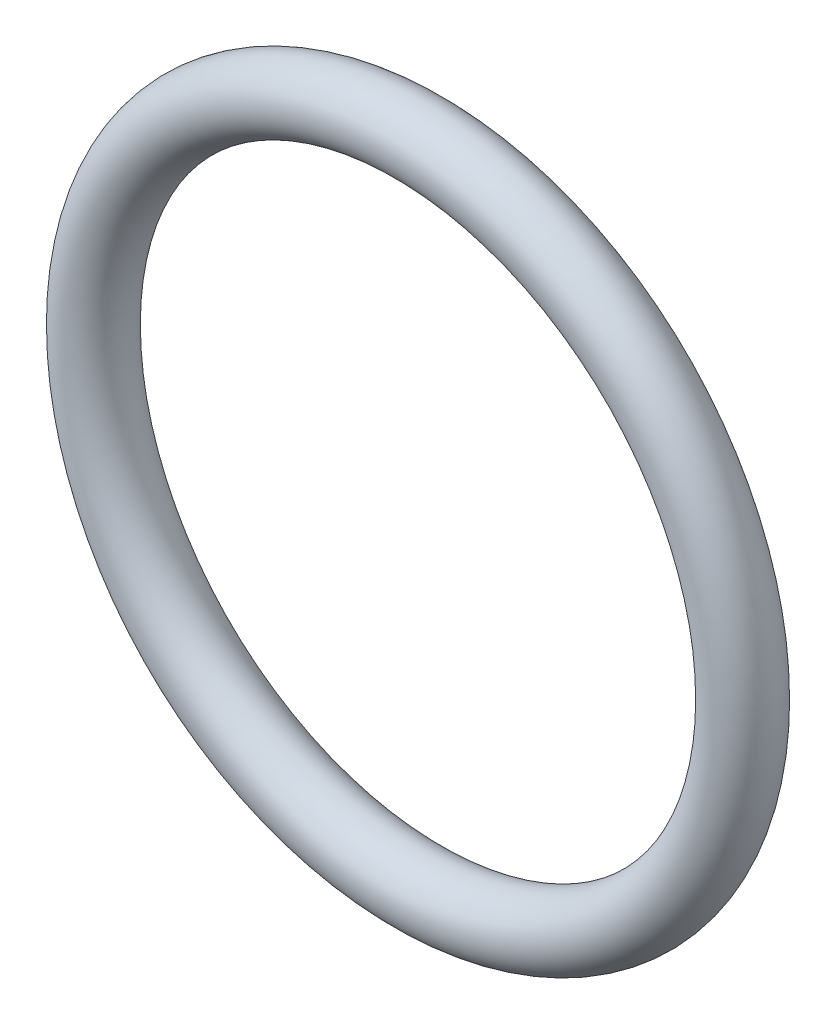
ISO-10303-21;
HEADER;
FILE_DESCRIPTION(('STEP AP214'),'2;1');
FILE_NAME('part.step','',(''),(''),'','','');
FILE_SCHEMA(('AUTOMOTIVE_DESIGN { 1 0 10303 214 1 1 1 1 }'));
ENDSEC;
DATA;
#1=APPLICATION_CONTEXT('core data for automotive mechanical design processes');
#2=APPLICATION_PROTOCOL_DEFINITION('international standard','automotive_design',2000,#1);
#3=PRODUCT_CONTEXT('',#1,'mechanical');
#4=PRODUCT('Part','Part','',(#3));
#5=PRODUCT_RELATED_PRODUCT_CATEGORY('part','',(#4));
#6=PRODUCT_DEFINITION_FORMATION('','',#4);
#7=PRODUCT_DEFINITION_CONTEXT('part definition',#1,'design');
#8=PRODUCT_DEFINITION('design','',#6,#7);
#9=PRODUCT_DEFINITION_SHAPE('','',#8);
#10=(LENGTH_UNIT() NAMED_UNIT(*) SI_UNIT(.MILLI.,.METRE.));
#11=(NAMED_UNIT(*) PLANE_ANGLE_UNIT() SI_UNIT($,.RADIAN.));
#12=(NAMED_UNIT(*) SI_UNIT($,.STERADIAN.) SOLID_ANGLE_UNIT());
#13=UNCERTAINTY_MEASURE_WITH_UNIT(LENGTH_MEASURE(1.E-05),#10,'distance_accuracy_value','');
#14=(GEOMETRIC_REPRESENTATION_CONTEXT(3) GLOBAL_UNCERTAINTY_ASSIGNED_CONTEXT((#13)) GLOBAL_UNIT_ASSIGNED_CONTEXT((#10,
#11,#12)) REPRESENTATION_CONTEXT('',''));
#15=CARTESIAN_POINT('',(0.,0.,0.));
#16=DIRECTION('',(0.,0.,1.));
#17=DIRECTION('',(1.,0.,0.));
#18=AXIS2_PLACEMENT_3D('',#15,#16,#17);
#19=CARTESIAN_POINT('',(0.,0.,0.));
#20=DIRECTION('',(0.,0.,-1.));
#21=DIRECTION('',(-1.,0.,0.));
#22=AXIS2_PLACEMENT_3D('',#19,#20,#21);
#23=TOROIDAL_SURFACE('',#22,8.6868,0.889);
#24=ADVANCED_FACE('F14',(),#23,.T.);
#25=CLOSED_SHELL('',(#24));
#26=MANIFOLD_SOLID_BREP('B1',#25);
#27=ADVANCED_BREP_SHAPE_REPRESENTATION('',(#18,#26),#14);
#28=SHAPE_DEFINITION_REPRESENTATION(#9,#27);
ENDSEC;
END-ISO-10303-21;
